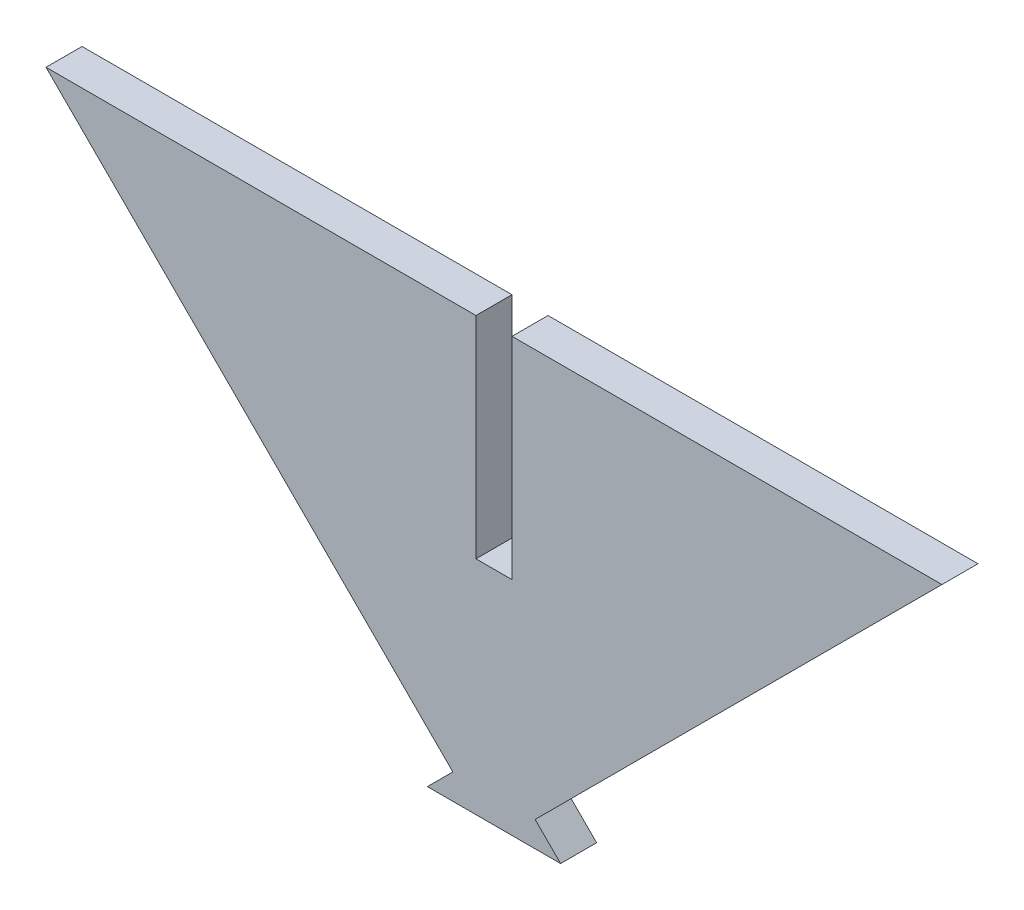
from build123d import *

# Parameters (mm, degrees)
EXTRUDE1_DEPTH = 12.7


with BuildPart() as part:
    # Sketch1 → Extrude1 (new body)
    with BuildSketch(Plane.XY):
        Polygon((-157.9248663, 175.885378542), (-14.505122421, 32.465634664), (-23.485378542, 23.485378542), (23.485378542, 23.485378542), (14.505122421, 32.465634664), (157.9248663, 175.885378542), (6.35, 175.885378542), (6.35, 101.6), (-6.35, 101.6), (-6.35, 175.885378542), align=None)
    extrude(amount=-EXTRUDE1_DEPTH)


solid = part.part
